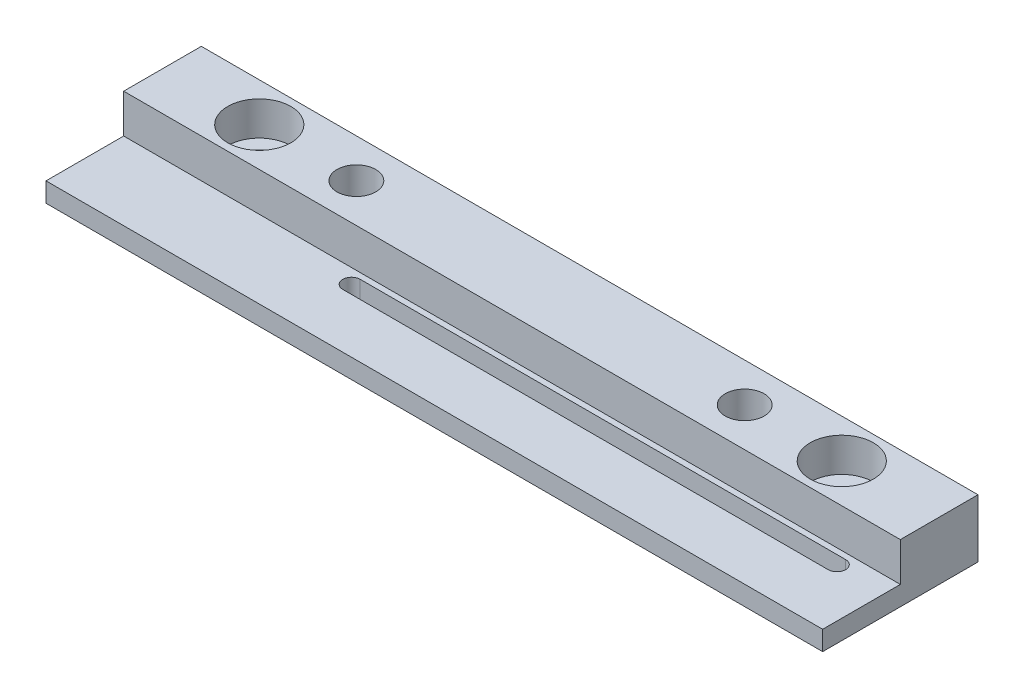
from build123d import *

# Parameters (mm, degrees)
SKETCH_1_W               = 80
SKETCH_1_H               = 6
EXTRUDE_1_DEPTH          = 16
SKETCH_2_R               = 1.75
SKETCH_2_R_2             = 2
CUT_EXTRUDE_1_DEPTH      = 16
SKETCH_3_R               = 3.25
CUT_EXTRUDE_2_DEPTH      = 3.5
CUT_EXTRUDE_3_DEPTH      = 82.804645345
CUT_EXTRUDE_3_DEPTH_BACK = 82.804645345


with BuildPart() as part:
    # Sketch 1 → Extrude 1 (new body)
    with BuildSketch(Plane.XY):
        with Locations((40, 3)):
            Rectangle(SKETCH_1_W, SKETCH_1_H)
    extrude(amount=EXTRUDE_1_DEPTH)

    # Sketch 2 → Cut-Extrude 1 (cut)
    with BuildSketch(Plane(origin=(0, 6, 0), x_dir=(1, 0, 0), z_dir=(0, 1, 0))):
        with Locations(Location((9.968687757, -4, 0), (0, 0, 270))):
            Circle(SKETCH_2_R)
        with Locations(Location((69.968687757, -4, 0), (0, 0, 270))):
            Circle(SKETCH_2_R)
        with Locations(Location((19.968687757, -4, 0), (0, 0, 270))):
            Circle(SKETCH_2_R_2)
        with Locations(Location((59.968687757, -4, 0), (0, 0, 270))):
            Circle(SKETCH_2_R_2)
        with BuildLine():
            Line((74.968687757, -8.6), (24.968687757, -8.6))
            ThreePointArc((24.968687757, -8.6), (24.068687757, -9.5), (24.968687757, -10.4))
            Line((24.968687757, -10.4), (74.968687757, -10.4))
            ThreePointArc((74.968687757, -10.4), (75.868687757, -9.5), (74.968687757, -8.6))
        make_face()
    extrude(amount=-CUT_EXTRUDE_1_DEPTH, mode=Mode.SUBTRACT)

    # Sketch 3 → Cut-Extrude 2 (cut)
    with BuildSketch(Plane(origin=(0, 6, 0), x_dir=(1, 0, 0), z_dir=(0, 1, 0))):
        with Locations(Location((9.968687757, -4, 0), (0, 0, 270))):
            Circle(SKETCH_3_R)
        with Locations(Location((69.968687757, -4, 0), (0, 0, 270))):
            Circle(SKETCH_3_R)
    extrude(amount=-CUT_EXTRUDE_2_DEPTH, mode=Mode.SUBTRACT)

    # Sketch 4 → Cut-Extrude 3 (cut, two sides: drawn at the far end of the back side and taken through both)
    with BuildSketch(Plane(origin=(80, 0, 0), x_dir=(0, 0, -1), z_dir=(1, 0, 0)).offset(-CUT_EXTRUDE_3_DEPTH_BACK)):
        Polygon((-58.984845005, 2), (-16, 2), (-8, 2), (-8, 6), (-8, 48.984845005), (-66.259229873, 112.203906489), (-117.244074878, 65.219061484), align=None)
    extrude(amount=CUT_EXTRUDE_3_DEPTH + CUT_EXTRUDE_3_DEPTH_BACK, mode=Mode.SUBTRACT)


solid = part.part
